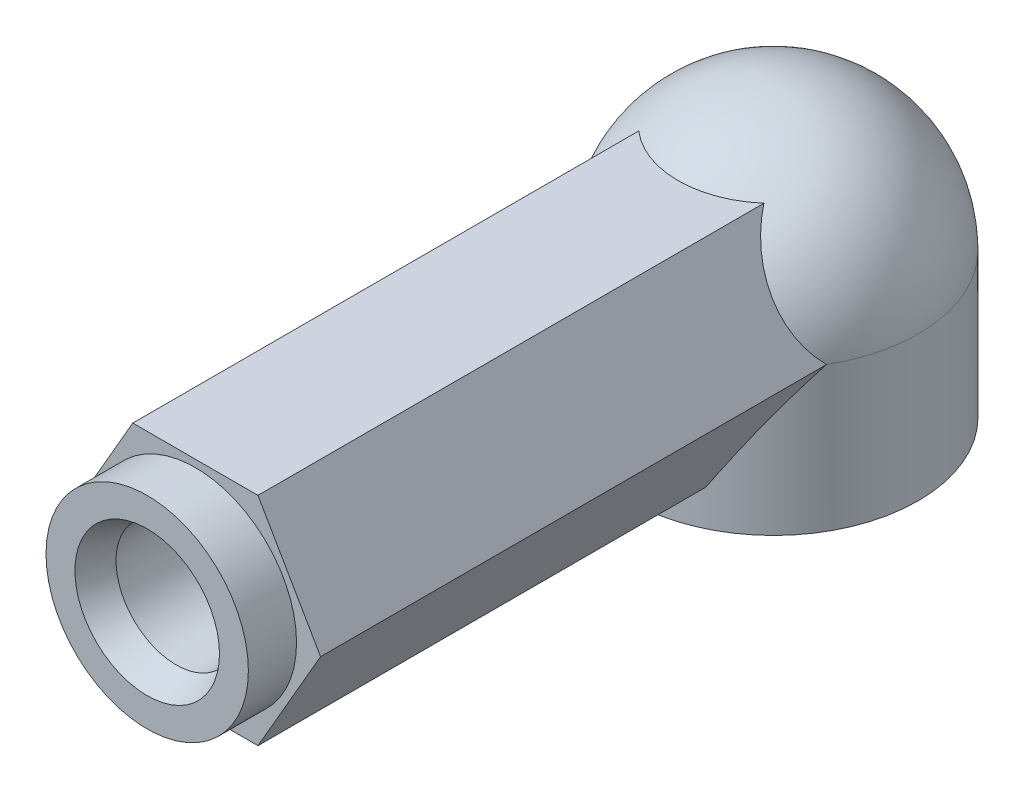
ISO-10303-21;
HEADER;
FILE_DESCRIPTION(('STEP AP214'),'2;1');
FILE_NAME('part.step','',(''),(''),'','','');
FILE_SCHEMA(('AUTOMOTIVE_DESIGN { 1 0 10303 214 1 1 1 1 }'));
ENDSEC;
DATA;
#1=APPLICATION_CONTEXT('core data for automotive mechanical design processes');
#2=APPLICATION_PROTOCOL_DEFINITION('international standard','automotive_design',2000,#1);
#3=PRODUCT_CONTEXT('',#1,'mechanical');
#4=PRODUCT('Part','Part','',(#3));
#5=PRODUCT_RELATED_PRODUCT_CATEGORY('part','',(#4));
#6=PRODUCT_DEFINITION_FORMATION('','',#4);
#7=PRODUCT_DEFINITION_CONTEXT('part definition',#1,'design');
#8=PRODUCT_DEFINITION('design','',#6,#7);
#9=PRODUCT_DEFINITION_SHAPE('','',#8);
#10=(LENGTH_UNIT() NAMED_UNIT(*) SI_UNIT(.MILLI.,.METRE.));
#11=(NAMED_UNIT(*) PLANE_ANGLE_UNIT() SI_UNIT($,.RADIAN.));
#12=(NAMED_UNIT(*) SI_UNIT($,.STERADIAN.) SOLID_ANGLE_UNIT());
#13=UNCERTAINTY_MEASURE_WITH_UNIT(LENGTH_MEASURE(1.E-05),#10,'distance_accuracy_value','');
#14=(GEOMETRIC_REPRESENTATION_CONTEXT(3) GLOBAL_UNCERTAINTY_ASSIGNED_CONTEXT((#13)) GLOBAL_UNIT_ASSIGNED_CONTEXT((#10,
#11,#12)) REPRESENTATION_CONTEXT('',''));
#15=CARTESIAN_POINT('',(0.,0.,0.));
#16=DIRECTION('',(0.,0.,1.));
#17=DIRECTION('',(1.,0.,0.));
#18=AXIS2_PLACEMENT_3D('',#15,#16,#17);
#19=CARTESIAN_POINT('',(3.89711431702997,2.25,12.));
#20=DIRECTION('',(0.,0.,1.));
#21=DIRECTION('',(1.,0.,0.));
#22=AXIS2_PLACEMENT_3D('',#19,#20,#21);
#23=PLANE('',#22);
#24=DIRECTION('',(0.5,0.866025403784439,0.));
#25=VECTOR('',#24,1.);
#26=CARTESIAN_POINT('',(1.29903810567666,-2.25,12.));
#27=LINE('',#26,#25);
#28=CARTESIAN_POINT('',(1.29903810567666,-2.25,12.));
#29=VERTEX_POINT('',#28);
#30=CARTESIAN_POINT('',(2.59807621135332,0.,12.));
#31=VERTEX_POINT('',#30);
#32=EDGE_CURVE('E458',#29,#31,#27,.T.);
#33=ORIENTED_EDGE('',*,*,#32,.T.);
#34=DIRECTION('',(-0.5,0.866025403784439,0.));
#35=VECTOR('',#34,1.);
#36=CARTESIAN_POINT('',(2.59807621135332,0.,12.));
#37=LINE('',#36,#35);
#38=CARTESIAN_POINT('',(1.29903810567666,2.25,12.));
#39=VERTEX_POINT('',#38);
#40=EDGE_CURVE('E460',#31,#39,#37,.T.);
#41=ORIENTED_EDGE('',*,*,#40,.T.);
#42=DIRECTION('',(-1.,0.,0.));
#43=VECTOR('',#42,1.);
#44=CARTESIAN_POINT('',(1.29903810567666,2.25,12.));
#45=LINE('',#44,#43);
#46=CARTESIAN_POINT('',(-1.29903810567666,2.25,12.));
#47=VERTEX_POINT('',#46);
#48=EDGE_CURVE('E462',#39,#47,#45,.T.);
#49=ORIENTED_EDGE('',*,*,#48,.T.);
#50=DIRECTION('',(-0.5,-0.866025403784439,0.));
#51=VECTOR('',#50,1.);
#52=CARTESIAN_POINT('',(-1.29903810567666,2.25,12.));
#53=LINE('',#52,#51);
#54=CARTESIAN_POINT('',(-2.59807621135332,0.,12.));
#55=VERTEX_POINT('',#54);
#56=EDGE_CURVE('E464',#47,#55,#53,.T.);
#57=ORIENTED_EDGE('',*,*,#56,.T.);
#58=DIRECTION('',(0.5,-0.866025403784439,0.));
#59=VECTOR('',#58,1.);
#60=CARTESIAN_POINT('',(-2.59807621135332,0.,12.));
#61=LINE('',#60,#59);
#62=CARTESIAN_POINT('',(-1.29903810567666,-2.25,12.));
#63=VERTEX_POINT('',#62);
#64=EDGE_CURVE('E466',#55,#63,#61,.T.);
#65=ORIENTED_EDGE('',*,*,#64,.T.);
#66=DIRECTION('',(1.,0.,0.));
#67=VECTOR('',#66,1.);
#68=CARTESIAN_POINT('',(-1.29903810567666,-2.25,12.));
#69=LINE('',#68,#67);
#70=EDGE_CURVE('E372',#63,#29,#69,.T.);
#71=ORIENTED_EDGE('',*,*,#70,.T.);
#72=EDGE_LOOP('',(#33,#41,#49,#57,#65,#71));
#73=FACE_BOUND('',#72,.T.);
#74=CARTESIAN_POINT('',(0.,0.,12.));
#75=DIRECTION('',(0.,0.,1.));
#76=DIRECTION('',(1.,0.,0.));
#77=AXIS2_PLACEMENT_3D('',#74,#75,#76);
#78=CIRCLE('',#77,2.1);
#79=CARTESIAN_POINT('',(2.1,0.,12.));
#80=VERTEX_POINT('',#79);
#81=EDGE_CURVE('E452',#80,#80,#78,.T.);
#82=ORIENTED_EDGE('',*,*,#81,.F.);
#83=EDGE_LOOP('',(#82));
#84=FACE_BOUND('',#83,.T.);
#85=ADVANCED_FACE('F350',(#73,#84),#23,.T.);
#86=CARTESIAN_POINT('',(1.29903810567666,-2.25,12.));
#87=DIRECTION('',(-0.866025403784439,0.5,0.));
#88=DIRECTION('',(-0.5,-0.866025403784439,0.));
#89=AXIS2_PLACEMENT_3D('',#86,#87,#88);
#90=PLANE('',#89);
#91=DIRECTION('',(0.,0.,-1.));
#92=VECTOR('',#91,1.);
#93=CARTESIAN_POINT('',(1.29903810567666,-2.25,12.));
#94=LINE('',#93,#92);
#95=CARTESIAN_POINT('',(1.29903810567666,-2.25,2.70416345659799));
#96=VERTEX_POINT('',#95);
#97=EDGE_CURVE('E469',#29,#96,#94,.T.);
#98=ORIENTED_EDGE('',*,*,#97,.T.);
#99=CARTESIAN_POINT('',(0.,-4.5,0.));
#100=DIRECTION('',(-0.866025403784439,0.5,0.));
#101=DIRECTION('',(-0.5,-0.866025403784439,0.));
#102=AXIS2_PLACEMENT_3D('',#99,#100,#101);
#103=ELLIPSE('',#102,6.00000000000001,3.);
#104=CARTESIAN_POINT('',(2.59807621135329,0.,1.50000000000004));
#105=VERTEX_POINT('',#104);
#106=EDGE_CURVE('E365',#96,#105,#103,.T.);
#107=ORIENTED_EDGE('',*,*,#106,.T.);
#108=DIRECTION('',(0.,0.,-1.));
#109=VECTOR('',#108,1.);
#110=CARTESIAN_POINT('',(2.59807621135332,0.,12.));
#111=LINE('',#110,#109);
#112=EDGE_CURVE('E358',#31,#105,#111,.T.);
#113=ORIENTED_EDGE('',*,*,#112,.F.);
#114=ORIENTED_EDGE('',*,*,#32,.F.);
#115=EDGE_LOOP('',(#98,#107,#113,#114));
#116=FACE_BOUND('',#115,.T.);
#117=ADVANCED_FACE('F352',(#116),#90,.F.);
#118=CARTESIAN_POINT('',(2.59807621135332,0.,12.));
#119=DIRECTION('',(-0.866025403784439,-0.5,0.));
#120=DIRECTION('',(0.5,-0.866025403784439,0.));
#121=AXIS2_PLACEMENT_3D('',#118,#119,#120);
#122=PLANE('',#121);
#123=ORIENTED_EDGE('',*,*,#112,.T.);
#124=CARTESIAN_POINT('',(1.94855715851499,1.125,0.));
#125=DIRECTION('',(-0.866025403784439,-0.5,0.));
#126=DIRECTION('',(0.5,-0.866025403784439,0.));
#127=AXIS2_PLACEMENT_3D('',#124,#125,#126);
#128=CIRCLE('',#127,1.98431348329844);
#129=CARTESIAN_POINT('',(1.29903810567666,2.25,1.5));
#130=VERTEX_POINT('',#129);
#131=EDGE_CURVE('E449',#105,#130,#128,.T.);
#132=ORIENTED_EDGE('',*,*,#131,.T.);
#133=DIRECTION('',(0.,0.,-1.));
#134=VECTOR('',#133,1.);
#135=CARTESIAN_POINT('',(1.29903810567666,2.25,12.));
#136=LINE('',#135,#134);
#137=EDGE_CURVE('E481',#39,#130,#136,.T.);
#138=ORIENTED_EDGE('',*,*,#137,.F.);
#139=ORIENTED_EDGE('',*,*,#40,.F.);
#140=EDGE_LOOP('',(#123,#132,#138,#139));
#141=FACE_BOUND('',#140,.T.);
#142=ADVANCED_FACE('F486',(#141),#122,.F.);
#143=CARTESIAN_POINT('',(1.29903810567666,2.25,12.));
#144=DIRECTION('',(0.,-1.,0.));
#145=DIRECTION('',(1.,0.,0.));
#146=AXIS2_PLACEMENT_3D('',#143,#144,#145);
#147=PLANE('',#146);
#148=ORIENTED_EDGE('',*,*,#137,.T.);
#149=CARTESIAN_POINT('',(0.,2.25,0.));
#150=DIRECTION('',(0.,-1.,0.));
#151=DIRECTION('',(1.,0.,0.));
#152=AXIS2_PLACEMENT_3D('',#149,#150,#151);
#153=CIRCLE('',#152,1.98431348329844);
#154=CARTESIAN_POINT('',(-1.29903810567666,2.25,1.5));
#155=VERTEX_POINT('',#154);
#156=EDGE_CURVE('E446',#130,#155,#153,.T.);
#157=ORIENTED_EDGE('',*,*,#156,.T.);
#158=DIRECTION('',(0.,0.,-1.));
#159=VECTOR('',#158,1.);
#160=CARTESIAN_POINT('',(-1.29903810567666,2.25,12.));
#161=LINE('',#160,#159);
#162=EDGE_CURVE('E478',#47,#155,#161,.T.);
#163=ORIENTED_EDGE('',*,*,#162,.F.);
#164=ORIENTED_EDGE('',*,*,#48,.F.);
#165=EDGE_LOOP('',(#148,#157,#163,#164));
#166=FACE_BOUND('',#165,.T.);
#167=ADVANCED_FACE('F506',(#166),#147,.F.);
#168=CARTESIAN_POINT('',(-1.29903810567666,2.25,12.));
#169=DIRECTION('',(0.866025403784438,-0.5,0.));
#170=DIRECTION('',(0.5,0.866025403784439,0.));
#171=AXIS2_PLACEMENT_3D('',#168,#169,#170);
#172=PLANE('',#171);
#173=ORIENTED_EDGE('',*,*,#162,.T.);
#174=CARTESIAN_POINT('',(-1.94855715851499,1.125,0.));
#175=DIRECTION('',(0.866025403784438,-0.5,0.));
#176=DIRECTION('',(0.5,0.866025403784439,0.));
#177=AXIS2_PLACEMENT_3D('',#174,#175,#176);
#178=CIRCLE('',#177,1.98431348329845);
#179=CARTESIAN_POINT('',(-2.59807621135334,0.,1.49999999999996));
#180=VERTEX_POINT('',#179);
#181=EDGE_CURVE('E443',#155,#180,#178,.T.);
#182=ORIENTED_EDGE('',*,*,#181,.T.);
#183=DIRECTION('',(0.,0.,-1.));
#184=VECTOR('',#183,1.);
#185=CARTESIAN_POINT('',(-2.59807621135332,0.,12.));
#186=LINE('',#185,#184);
#187=EDGE_CURVE('E475',#55,#180,#186,.T.);
#188=ORIENTED_EDGE('',*,*,#187,.F.);
#189=ORIENTED_EDGE('',*,*,#56,.F.);
#190=EDGE_LOOP('',(#173,#182,#188,#189));
#191=FACE_BOUND('',#190,.T.);
#192=ADVANCED_FACE('F501',(#191),#172,.F.);
#193=CARTESIAN_POINT('',(-2.59807621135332,0.,12.));
#194=DIRECTION('',(0.866025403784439,0.5,0.));
#195=DIRECTION('',(-0.5,0.866025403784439,0.));
#196=AXIS2_PLACEMENT_3D('',#193,#194,#195);
#197=PLANE('',#196);
#198=ORIENTED_EDGE('',*,*,#187,.T.);
#199=CARTESIAN_POINT('',(0.,-4.5,0.));
#200=DIRECTION('',(0.866025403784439,0.5,0.));
#201=DIRECTION('',(0.5,-0.866025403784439,0.));
#202=AXIS2_PLACEMENT_3D('',#199,#200,#201);
#203=ELLIPSE('',#202,6.,3.);
#204=CARTESIAN_POINT('',(-1.29903810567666,-2.25,2.70416345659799));
#205=VERTEX_POINT('',#204);
#206=EDGE_CURVE('E439',#180,#205,#203,.T.);
#207=ORIENTED_EDGE('',*,*,#206,.T.);
#208=DIRECTION('',(0.,0.,-1.));
#209=VECTOR('',#208,1.);
#210=CARTESIAN_POINT('',(-1.29903810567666,-2.25,12.));
#211=LINE('',#210,#209);
#212=EDGE_CURVE('E472',#63,#205,#211,.T.);
#213=ORIENTED_EDGE('',*,*,#212,.F.);
#214=ORIENTED_EDGE('',*,*,#64,.F.);
#215=EDGE_LOOP('',(#198,#207,#213,#214));
#216=FACE_BOUND('',#215,.T.);
#217=ADVANCED_FACE('F496',(#216),#197,.F.);
#218=CARTESIAN_POINT('',(-1.29903810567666,-2.25,12.));
#219=DIRECTION('',(0.,1.,0.));
#220=DIRECTION('',(0.,0.,1.));
#221=AXIS2_PLACEMENT_3D('',#218,#219,#220);
#222=PLANE('',#221);
#223=ORIENTED_EDGE('',*,*,#212,.T.);
#224=CARTESIAN_POINT('',(0.,-2.25,0.));
#225=DIRECTION('',(0.,1.,0.));
#226=DIRECTION('',(0.,0.,1.));
#227=AXIS2_PLACEMENT_3D('',#224,#225,#226);
#228=CIRCLE('',#227,3.);
#229=EDGE_CURVE('E11',#205,#96,#228,.T.);
#230=ORIENTED_EDGE('',*,*,#229,.T.);
#231=ORIENTED_EDGE('',*,*,#97,.F.);
#232=ORIENTED_EDGE('',*,*,#70,.F.);
#233=EDGE_LOOP('',(#223,#230,#231,#232));
#234=FACE_BOUND('',#233,.T.);
#235=ADVANCED_FACE('F491',(#234),#222,.F.);
#236=CARTESIAN_POINT('',(0.,0.,13.));
#237=DIRECTION('',(0.,0.,-1.));
#238=DIRECTION('',(-1.,0.,0.));
#239=AXIS2_PLACEMENT_3D('',#236,#237,#238);
#240=CYLINDRICAL_SURFACE('',#239,2.1);
#241=CARTESIAN_POINT('',(0.,0.,13.));
#242=DIRECTION('',(0.,0.,1.));
#243=DIRECTION('',(1.,0.,0.));
#244=AXIS2_PLACEMENT_3D('',#241,#242,#243);
#245=CIRCLE('',#244,2.1);
#246=CARTESIAN_POINT('',(2.1,0.,13.));
#247=VERTEX_POINT('',#246);
#248=EDGE_CURVE('E455',#247,#247,#245,.T.);
#249=ORIENTED_EDGE('',*,*,#248,.F.);
#250=EDGE_LOOP('',(#249));
#251=FACE_BOUND('',#250,.T.);
#252=ORIENTED_EDGE('',*,*,#81,.T.);
#253=EDGE_LOOP('',(#252));
#254=FACE_BOUND('',#253,.T.);
#255=ADVANCED_FACE('F513',(#251,#254),#240,.T.);
#256=CARTESIAN_POINT('',(0.,0.,13.));
#257=DIRECTION('',(0.,0.,1.));
#258=DIRECTION('',(1.,0.,0.));
#259=AXIS2_PLACEMENT_3D('',#256,#257,#258);
#260=PLANE('',#259);
#261=CARTESIAN_POINT('',(0.,0.,13.0000000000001));
#262=DIRECTION('',(0.,0.,1.));
#263=DIRECTION('',(1.,0.,0.));
#264=AXIS2_PLACEMENT_3D('',#261,#262,#263);
#265=CIRCLE('',#264,1.50000000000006);
#266=CARTESIAN_POINT('',(1.50000000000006,0.,13.0000000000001));
#267=VERTEX_POINT('',#266);
#268=EDGE_CURVE('E417',#267,#267,#265,.T.);
#269=ORIENTED_EDGE('',*,*,#268,.F.);
#270=EDGE_LOOP('',(#269));
#271=FACE_BOUND('',#270,.T.);
#272=ORIENTED_EDGE('',*,*,#248,.T.);
#273=EDGE_LOOP('',(#272));
#274=FACE_BOUND('',#273,.T.);
#275=ADVANCED_FACE('F515',(#271,#274),#260,.T.);
#276=CARTESIAN_POINT('',(0.,0.,0.));
#277=DIRECTION('',(0.,-1.,0.));
#278=DIRECTION('',(0.,0.,-1.));
#279=AXIS2_PLACEMENT_3D('',#276,#277,#278);
#280=SPHERICAL_SURFACE('',#279,3.);
#281=ORIENTED_EDGE('',*,*,#131,.F.);
#282=CARTESIAN_POINT('',(0.,0.,0.));
#283=DIRECTION('',(0.,-1.,0.));
#284=DIRECTION('',(0.,0.,-1.));
#285=AXIS2_PLACEMENT_3D('',#282,#283,#284);
#286=CIRCLE('',#285,3.);
#287=EDGE_CURVE('E437',#180,#105,#286,.T.);
#288=ORIENTED_EDGE('',*,*,#287,.F.);
#289=ORIENTED_EDGE('',*,*,#181,.F.);
#290=ORIENTED_EDGE('',*,*,#156,.F.);
#291=EDGE_LOOP('',(#281,#288,#289,#290));
#292=FACE_BOUND('',#291,.T.);
#293=ADVANCED_FACE('F504',(#292),#280,.T.);
#294=CARTESIAN_POINT('',(0.,3.,0.));
#295=DIRECTION('',(0.,-1.,0.));
#296=DIRECTION('',(0.,0.,-1.));
#297=AXIS2_PLACEMENT_3D('',#294,#295,#296);
#298=CYLINDRICAL_SURFACE('',#297,3.);
#299=CARTESIAN_POINT('',(0.,-3.,0.));
#300=DIRECTION('',(0.,-1.,0.));
#301=DIRECTION('',(0.,0.,-1.));
#302=AXIS2_PLACEMENT_3D('',#299,#300,#301);
#303=CIRCLE('',#302,3.);
#304=CARTESIAN_POINT('',(0.,-3.,-3.));
#305=VERTEX_POINT('',#304);
#306=EDGE_CURVE('E434',#305,#305,#303,.T.);
#307=ORIENTED_EDGE('',*,*,#306,.F.);
#308=EDGE_LOOP('',(#307));
#309=FACE_BOUND('',#308,.T.);
#310=ORIENTED_EDGE('',*,*,#106,.F.);
#311=ORIENTED_EDGE('',*,*,#229,.F.);
#312=ORIENTED_EDGE('',*,*,#206,.F.);
#313=ORIENTED_EDGE('',*,*,#287,.T.);
#314=EDGE_LOOP('',(#310,#311,#312,#313));
#315=FACE_BOUND('',#314,.T.);
#316=ADVANCED_FACE('F493',(#309,#315),#298,.T.);
#317=CARTESIAN_POINT('',(0.,-3.,0.));
#318=DIRECTION('',(0.,-1.,0.));
#319=DIRECTION('',(0.,0.,-1.));
#320=AXIS2_PLACEMENT_3D('',#317,#318,#319);
#321=PLANE('',#320);
#322=CARTESIAN_POINT('',(0.,-3.,0.));
#323=DIRECTION('',(0.,-1.,0.));
#324=DIRECTION('',(0.,0.,-1.));
#325=AXIS2_PLACEMENT_3D('',#322,#323,#324);
#326=CIRCLE('',#325,2.);
#327=CARTESIAN_POINT('',(0.,-3.,-2.));
#328=VERTEX_POINT('',#327);
#329=EDGE_CURVE('E431',#328,#328,#326,.T.);
#330=ORIENTED_EDGE('',*,*,#329,.F.);
#331=EDGE_LOOP('',(#330));
#332=FACE_BOUND('',#331,.T.);
#333=ORIENTED_EDGE('',*,*,#306,.T.);
#334=EDGE_LOOP('',(#333));
#335=FACE_BOUND('',#334,.T.);
#336=ADVANCED_FACE('F554',(#332,#335),#321,.T.);
#337=CARTESIAN_POINT('',(0.,2.,0.));
#338=DIRECTION('',(0.,-1.,0.));
#339=DIRECTION('',(0.,0.,-1.));
#340=AXIS2_PLACEMENT_3D('',#337,#338,#339);
#341=CYLINDRICAL_SURFACE('',#340,2.);
#342=CARTESIAN_POINT('',(0.,-2.5,0.));
#343=DIRECTION('',(0.,-1.,0.));
#344=DIRECTION('',(0.,0.,-1.));
#345=AXIS2_PLACEMENT_3D('',#342,#343,#344);
#346=CIRCLE('',#345,2.);
#347=CARTESIAN_POINT('',(0.,-2.5,-2.));
#348=VERTEX_POINT('',#347);
#349=EDGE_CURVE('E428',#348,#348,#346,.T.);
#350=ORIENTED_EDGE('',*,*,#349,.F.);
#351=EDGE_LOOP('',(#350));
#352=FACE_BOUND('',#351,.T.);
#353=ORIENTED_EDGE('',*,*,#329,.T.);
#354=EDGE_LOOP('',(#353));
#355=FACE_BOUND('',#354,.T.);
#356=ADVANCED_FACE('F559',(#352,#355),#341,.F.);
#357=CARTESIAN_POINT('',(0.,-2.5,0.));
#358=DIRECTION('',(0.,-1.,0.));
#359=DIRECTION('',(0.,0.,-1.));
#360=AXIS2_PLACEMENT_3D('',#357,#358,#359);
#361=CONICAL_SURFACE('',#360,2.,0.785398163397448);
#362=CARTESIAN_POINT('',(0.,-2.,0.));
#363=DIRECTION('',(0.,-1.,0.));
#364=DIRECTION('',(0.,0.,-1.));
#365=AXIS2_PLACEMENT_3D('',#362,#363,#364);
#366=CIRCLE('',#365,1.5);
#367=CARTESIAN_POINT('',(0.,-2.,-1.5));
#368=VERTEX_POINT('',#367);
#369=EDGE_CURVE('E425',#368,#368,#366,.T.);
#370=ORIENTED_EDGE('',*,*,#369,.F.);
#371=EDGE_LOOP('',(#370));
#372=FACE_BOUND('',#371,.T.);
#373=ORIENTED_EDGE('',*,*,#349,.T.);
#374=EDGE_LOOP('',(#373));
#375=FACE_BOUND('',#374,.T.);
#376=ADVANCED_FACE('F571',(#372,#375),#361,.F.);
#377=CARTESIAN_POINT('',(0.,2.,0.));
#378=DIRECTION('',(0.,-1.,0.));
#379=DIRECTION('',(0.,0.,-1.));
#380=AXIS2_PLACEMENT_3D('',#377,#378,#379);
#381=CYLINDRICAL_SURFACE('',#380,1.5);
#382=CARTESIAN_POINT('',(0.,-1.32287565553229,0.));
#383=DIRECTION('',(0.,-1.,0.));
#384=DIRECTION('',(0.,0.,-1.));
#385=AXIS2_PLACEMENT_3D('',#382,#383,#384);
#386=CIRCLE('',#385,1.5);
#387=CARTESIAN_POINT('',(0.,-1.32287565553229,-1.5));
#388=VERTEX_POINT('',#387);
#389=EDGE_CURVE('E422',#388,#388,#386,.T.);
#390=ORIENTED_EDGE('',*,*,#389,.F.);
#391=EDGE_LOOP('',(#390));
#392=FACE_BOUND('',#391,.T.);
#393=ORIENTED_EDGE('',*,*,#369,.T.);
#394=EDGE_LOOP('',(#393));
#395=FACE_BOUND('',#394,.T.);
#396=ADVANCED_FACE('F575',(#392,#395),#381,.F.);
#397=CARTESIAN_POINT('',(0.,0.,0.));
#398=DIRECTION('',(0.,-1.,0.));
#399=DIRECTION('',(0.,0.,-1.));
#400=AXIS2_PLACEMENT_3D('',#397,#398,#399);
#401=SPHERICAL_SURFACE('',#400,2.);
#402=ORIENTED_EDGE('',*,*,#389,.T.);
#403=EDGE_LOOP('',(#402));
#404=FACE_BOUND('',#403,.T.);
#405=ADVANCED_FACE('F579',(#404),#401,.F.);
#406=CARTESIAN_POINT('',(0.,0.,13.0000000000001));
#407=DIRECTION('',(0.,0.,1.));
#408=DIRECTION('',(1.,0.,0.));
#409=AXIS2_PLACEMENT_3D('',#406,#407,#408);
#410=CONICAL_SURFACE('',#409,1.50000000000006,0.392699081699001);
#411=CARTESIAN_POINT('',(0.,0.,12.3964466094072));
#412=DIRECTION('',(0.,0.,1.));
#413=DIRECTION('',(1.,0.,0.));
#414=AXIS2_PLACEMENT_3D('',#411,#412,#413);
#415=CIRCLE('',#414,1.25);
#416=CARTESIAN_POINT('',(1.25,0.,12.3964466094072));
#417=VERTEX_POINT('',#416);
#418=EDGE_CURVE('E414',#417,#417,#415,.T.);
#419=ORIENTED_EDGE('',*,*,#418,.F.);
#420=EDGE_LOOP('',(#419));
#421=FACE_BOUND('',#420,.T.);
#422=ORIENTED_EDGE('',*,*,#268,.T.);
#423=EDGE_LOOP('',(#422));
#424=FACE_BOUND('',#423,.T.);
#425=ADVANCED_FACE('F583',(#421,#424),#410,.F.);
#426=CARTESIAN_POINT('',(0.,0.,13.));
#427=DIRECTION('',(0.,0.,1.));
#428=DIRECTION('',(1.,0.,0.));
#429=AXIS2_PLACEMENT_3D('',#426,#427,#428);
#430=CYLINDRICAL_SURFACE('',#429,1.25);
#431=CARTESIAN_POINT('',(0.,0.,3.5));
#432=DIRECTION('',(0.,0.,1.));
#433=DIRECTION('',(1.,0.,0.));
#434=AXIS2_PLACEMENT_3D('',#431,#432,#433);
#435=CIRCLE('',#434,1.25);
#436=CARTESIAN_POINT('',(1.25,0.,3.5));
#437=VERTEX_POINT('',#436);
#438=EDGE_CURVE('E412',#437,#437,#435,.T.);
#439=ORIENTED_EDGE('',*,*,#438,.F.);
#440=EDGE_LOOP('',(#439));
#441=FACE_BOUND('',#440,.T.);
#442=ORIENTED_EDGE('',*,*,#418,.T.);
#443=EDGE_LOOP('',(#442));
#444=FACE_BOUND('',#443,.T.);
#445=ADVANCED_FACE('F408',(#441,#444),#430,.F.);
#446=CARTESIAN_POINT('',(0.,0.,3.5));
#447=DIRECTION('',(0.,0.,1.));
#448=DIRECTION('',(1.,0.,0.));
#449=AXIS2_PLACEMENT_3D('',#446,#447,#448);
#450=CONICAL_SURFACE('',#449,1.25,1.02974425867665);
#451=CARTESIAN_POINT('',(0.,0.,2.74892422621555));
#452=VERTEX_POINT('',#451);
#453=VERTEX_LOOP('',#452);
#454=FACE_BOUND('',#453,.T.);
#455=ORIENTED_EDGE('',*,*,#438,.T.);
#456=EDGE_LOOP('',(#455));
#457=FACE_BOUND('',#456,.T.);
#458=ADVANCED_FACE('F405',(#454,#457),#450,.F.);
#459=CLOSED_SHELL('',(#85,#117,#142,#167,#192,#217,#235,#255,#275,#293,#316,#336,#356,#376,#396,
#405,#425,#445,#458));
#460=MANIFOLD_SOLID_BREP('B2',#459);
#461=ADVANCED_BREP_SHAPE_REPRESENTATION('',(#18,#460),#14);
#462=SHAPE_DEFINITION_REPRESENTATION(#9,#461);
ENDSEC;
END-ISO-10303-21;
